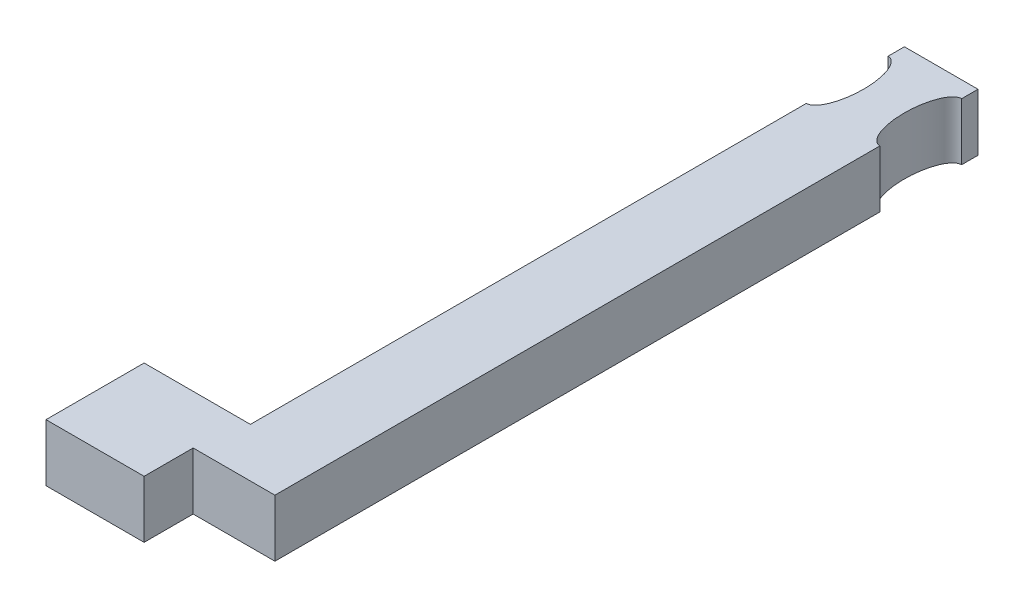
from build123d import *

# Parameters (mm, degrees)
BOSS_EXTRU_1_DEPTH      = 3.5
ESQUISSE2_W             = 3.4
ESQUISSE2_H             = 3.4
ENL_V_MAT_EXTRU_1_DEPTH = 2.5


with BuildPart() as part:
    # Esquisse1 → Boss.-Extru.1 (new body)
    with BuildSketch(Plane(origin=(0, 0, 0), x_dir=(1, 0, 0), z_dir=(0, 1, 0))):
        with BuildLine():
            Line((6, 3), (11, 3))
            Line((11, 3), (11, 40))
            add(Edge.make_bspline(
                [(11, 45), (10, 45), (10, 42.5), (10, 40), (11, 40)],
                knots=[0, 0, 0, 1.570796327, 1.570796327, 3.141592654, 3.141592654, 3.141592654], degree=2, weights=[1, 0.707106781, 1, 0.707106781, 1]))
            Line((11, 45), (11, 46))
            Line((11, 46), (6.5, 46))
            Line((6.5, 46), (6.5, 45))
            add(Edge.make_bspline(
                [(6.5, 40), (7.5, 40), (7.5, 42.5), (7.5, 45), (6.5, 45)],
                knots=[3.141592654, 3.141592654, 3.141592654, 4.71238898, 4.71238898, 6.283185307, 6.283185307, 6.283185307], degree=2, weights=[1, 0.707106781, 1, 0.707106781, 1]))
            Line((6.5, 40), (6.5, 6))
            Line((6.5, 6), (0, 6))
            Line((0, 6), (0, 0))
            Line((0, 0), (6, 0))
            Line((6, 0), (6, 3))
        make_face()
    extrude(amount=BOSS_EXTRU_1_DEPTH)

    # Esquisse2 → Enl_v. mat.-Extru.1 (cut)
    with BuildSketch(Plane.XZ):
        with Locations((3, -3)):
            Rectangle(ESQUISSE2_W, ESQUISSE2_H)
    extrude(amount=-ENL_V_MAT_EXTRU_1_DEPTH, mode=Mode.SUBTRACT)


solid = part.part
